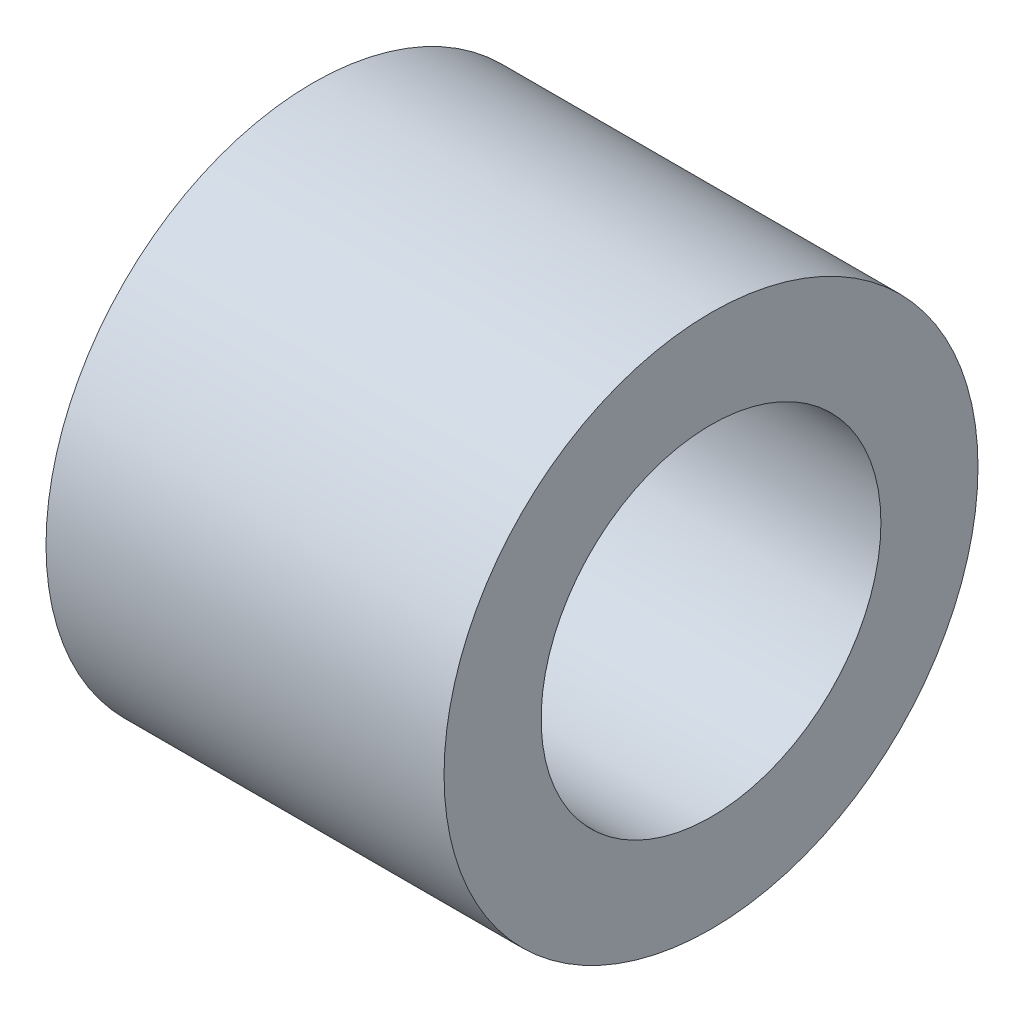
ISO-10303-21;
HEADER;
FILE_DESCRIPTION(('STEP AP214'),'2;1');
FILE_NAME('part.step','',(''),(''),'','','');
FILE_SCHEMA(('AUTOMOTIVE_DESIGN { 1 0 10303 214 1 1 1 1 }'));
ENDSEC;
DATA;
#1=APPLICATION_CONTEXT('core data for automotive mechanical design processes');
#2=APPLICATION_PROTOCOL_DEFINITION('international standard','automotive_design',2000,#1);
#3=PRODUCT_CONTEXT('',#1,'mechanical');
#4=PRODUCT('Part','Part','',(#3));
#5=PRODUCT_RELATED_PRODUCT_CATEGORY('part','',(#4));
#6=PRODUCT_DEFINITION_FORMATION('','',#4);
#7=PRODUCT_DEFINITION_CONTEXT('part definition',#1,'design');
#8=PRODUCT_DEFINITION('design','',#6,#7);
#9=PRODUCT_DEFINITION_SHAPE('','',#8);
#10=(LENGTH_UNIT() NAMED_UNIT(*) SI_UNIT(.MILLI.,.METRE.));
#11=(NAMED_UNIT(*) PLANE_ANGLE_UNIT() SI_UNIT($,.RADIAN.));
#12=(NAMED_UNIT(*) SI_UNIT($,.STERADIAN.) SOLID_ANGLE_UNIT());
#13=UNCERTAINTY_MEASURE_WITH_UNIT(LENGTH_MEASURE(1.E-05),#10,'distance_accuracy_value','');
#14=(GEOMETRIC_REPRESENTATION_CONTEXT(3) GLOBAL_UNCERTAINTY_ASSIGNED_CONTEXT((#13)) GLOBAL_UNIT_ASSIGNED_CONTEXT((#10,
#11,#12)) REPRESENTATION_CONTEXT('',''));
#15=CARTESIAN_POINT('',(0.,0.,0.));
#16=DIRECTION('',(0.,0.,1.));
#17=DIRECTION('',(1.,0.,0.));
#18=AXIS2_PLACEMENT_3D('',#15,#16,#17);
#19=CARTESIAN_POINT('',(-2.255,0.,0.));
#20=DIRECTION('',(1.,0.,0.));
#21=DIRECTION('',(0.,0.,-1.));
#22=AXIS2_PLACEMENT_3D('',#19,#20,#21);
#23=CYLINDRICAL_SURFACE('',#22,1.75);
#24=CARTESIAN_POINT('',(2.05,0.,0.));
#25=DIRECTION('',(1.,0.,0.));
#26=DIRECTION('',(0.,0.,-1.));
#27=AXIS2_PLACEMENT_3D('',#24,#25,#26);
#28=CIRCLE('',#27,1.75);
#29=CARTESIAN_POINT('',(2.05,0.,-1.75));
#30=VERTEX_POINT('',#29);
#31=EDGE_CURVE('E27',#30,#30,#28,.F.);
#32=ORIENTED_EDGE('',*,*,#31,.F.);
#33=EDGE_LOOP('',(#32));
#34=FACE_BOUND('',#33,.T.);
#35=CARTESIAN_POINT('',(-2.05,0.,0.));
#36=DIRECTION('',(1.,0.,0.));
#37=DIRECTION('',(0.,0.,-1.));
#38=AXIS2_PLACEMENT_3D('',#35,#36,#37);
#39=CIRCLE('',#38,1.75);
#40=CARTESIAN_POINT('',(-2.05,0.,-1.75));
#41=VERTEX_POINT('',#40);
#42=EDGE_CURVE('E18',#41,#41,#39,.F.);
#43=ORIENTED_EDGE('',*,*,#42,.T.);
#44=EDGE_LOOP('',(#43));
#45=FACE_BOUND('',#44,.T.);
#46=ADVANCED_FACE('F15',(#34,#45),#23,.F.);
#47=CARTESIAN_POINT('',(-2.05,0.,0.));
#48=DIRECTION('',(1.,0.,0.));
#49=DIRECTION('',(0.,0.,-1.));
#50=AXIS2_PLACEMENT_3D('',#47,#48,#49);
#51=PLANE('',#50);
#52=ORIENTED_EDGE('',*,*,#42,.F.);
#53=EDGE_LOOP('',(#52));
#54=FACE_BOUND('',#53,.T.);
#55=CARTESIAN_POINT('',(-2.05,0.,0.));
#56=DIRECTION('',(1.,0.,0.));
#57=DIRECTION('',(0.,0.,-1.));
#58=AXIS2_PLACEMENT_3D('',#55,#56,#57);
#59=CIRCLE('',#58,2.75);
#60=CARTESIAN_POINT('',(-2.05,0.,-2.75));
#61=VERTEX_POINT('',#60);
#62=EDGE_CURVE('E22',#61,#61,#59,.T.);
#63=ORIENTED_EDGE('',*,*,#62,.F.);
#64=EDGE_LOOP('',(#63));
#65=FACE_BOUND('',#64,.T.);
#66=ADVANCED_FACE('F36',(#54,#65),#51,.F.);
#67=CARTESIAN_POINT('',(2.05,0.,0.));
#68=DIRECTION('',(1.,0.,0.));
#69=DIRECTION('',(0.,0.,-1.));
#70=AXIS2_PLACEMENT_3D('',#67,#68,#69);
#71=PLANE('',#70);
#72=ORIENTED_EDGE('',*,*,#31,.T.);
#73=EDGE_LOOP('',(#72));
#74=FACE_BOUND('',#73,.T.);
#75=CARTESIAN_POINT('',(2.05,0.,0.));
#76=DIRECTION('',(1.,0.,0.));
#77=DIRECTION('',(0.,0.,-1.));
#78=AXIS2_PLACEMENT_3D('',#75,#76,#77);
#79=CIRCLE('',#78,2.75);
#80=CARTESIAN_POINT('',(2.05,0.,-2.75));
#81=VERTEX_POINT('',#80);
#82=EDGE_CURVE('E10',#81,#81,#79,.F.);
#83=ORIENTED_EDGE('',*,*,#82,.F.);
#84=EDGE_LOOP('',(#83));
#85=FACE_BOUND('',#84,.T.);
#86=ADVANCED_FACE('F39',(#74,#85),#71,.T.);
#87=CARTESIAN_POINT('',(-2.255,0.,0.));
#88=DIRECTION('',(1.,0.,0.));
#89=DIRECTION('',(0.,0.,-1.));
#90=AXIS2_PLACEMENT_3D('',#87,#88,#89);
#91=CYLINDRICAL_SURFACE('',#90,2.75);
#92=ORIENTED_EDGE('',*,*,#82,.T.);
#93=EDGE_LOOP('',(#92));
#94=FACE_BOUND('',#93,.T.);
#95=ORIENTED_EDGE('',*,*,#62,.T.);
#96=EDGE_LOOP('',(#95));
#97=FACE_BOUND('',#96,.T.);
#98=ADVANCED_FACE('F42',(#94,#97),#91,.T.);
#99=CLOSED_SHELL('',(#46,#66,#86,#98));
#100=MANIFOLD_SOLID_BREP('B1',#99);
#101=ADVANCED_BREP_SHAPE_REPRESENTATION('',(#18,#100),#14);
#102=SHAPE_DEFINITION_REPRESENTATION(#9,#101);
ENDSEC;
END-ISO-10303-21;
